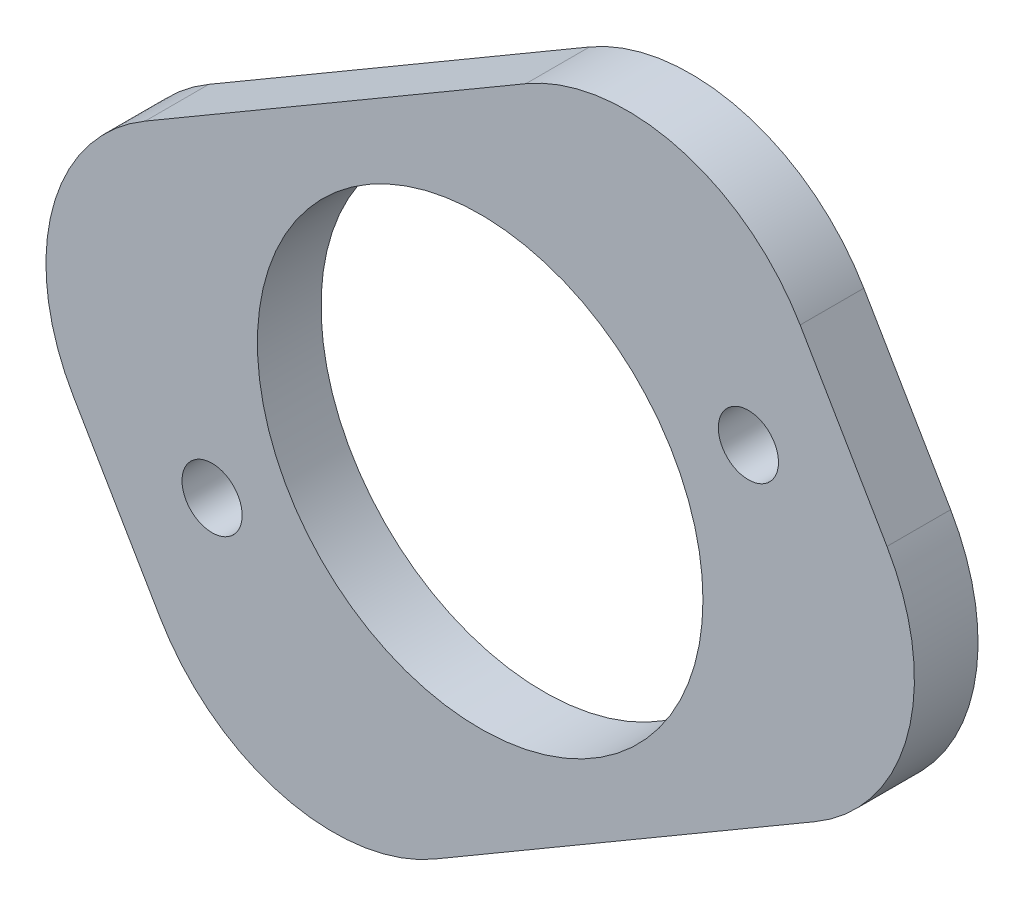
ISO-10303-21;
HEADER;
FILE_DESCRIPTION(('STEP AP214'),'2;1');
FILE_NAME('part.step','',(''),(''),'','','');
FILE_SCHEMA(('AUTOMOTIVE_DESIGN { 1 0 10303 214 1 1 1 1 }'));
ENDSEC;
DATA;
#1=APPLICATION_CONTEXT('core data for automotive mechanical design processes');
#2=APPLICATION_PROTOCOL_DEFINITION('international standard','automotive_design',2000,#1);
#3=PRODUCT_CONTEXT('',#1,'mechanical');
#4=PRODUCT('Part','Part','',(#3));
#5=PRODUCT_RELATED_PRODUCT_CATEGORY('part','',(#4));
#6=PRODUCT_DEFINITION_FORMATION('','',#4);
#7=PRODUCT_DEFINITION_CONTEXT('part definition',#1,'design');
#8=PRODUCT_DEFINITION('design','',#6,#7);
#9=PRODUCT_DEFINITION_SHAPE('','',#8);
#10=(LENGTH_UNIT() NAMED_UNIT(*) SI_UNIT(.MILLI.,.METRE.));
#11=(NAMED_UNIT(*) PLANE_ANGLE_UNIT() SI_UNIT($,.RADIAN.));
#12=(NAMED_UNIT(*) SI_UNIT($,.STERADIAN.) SOLID_ANGLE_UNIT());
#13=UNCERTAINTY_MEASURE_WITH_UNIT(LENGTH_MEASURE(1.E-05),#10,'distance_accuracy_value','');
#14=(GEOMETRIC_REPRESENTATION_CONTEXT(3) GLOBAL_UNCERTAINTY_ASSIGNED_CONTEXT((#13)) GLOBAL_UNIT_ASSIGNED_CONTEXT((#10,
#11,#12)) REPRESENTATION_CONTEXT('',''));
#15=CARTESIAN_POINT('',(0.,0.,0.));
#16=DIRECTION('',(0.,0.,1.));
#17=DIRECTION('',(1.,0.,0.));
#18=AXIS2_PLACEMENT_3D('',#15,#16,#17);
#19=CARTESIAN_POINT('',(129.491108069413,75.7585491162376,3.175));
#20=DIRECTION('',(-0.863133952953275,-0.504975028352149,0.));
#21=DIRECTION('',(0.504975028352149,-0.863133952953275,0.));
#22=AXIS2_PLACEMENT_3D('',#19,#20,#21);
#23=PLANE('',#22);
#24=DIRECTION('',(-0.504975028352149,0.863133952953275,0.));
#25=VECTOR('',#24,1.);
#26=CARTESIAN_POINT('',(129.491108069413,75.7585491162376,3.175));
#27=LINE('',#26,#25);
#28=CARTESIAN_POINT('',(-15.2304439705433,323.125405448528,3.175));
#29=VERTEX_POINT('',#28);
#30=CARTESIAN_POINT('',(-19.560604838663,330.526779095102,3.175));
#31=VERTEX_POINT('',#30);
#32=EDGE_CURVE('E198',#29,#31,#27,.T.);
#33=ORIENTED_EDGE('',*,*,#32,.F.);
#34=DIRECTION('',(0.,0.,-1.));
#35=VECTOR('',#34,1.);
#36=CARTESIAN_POINT('',(-15.2304439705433,323.125405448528,0.));
#37=LINE('',#36,#35);
#38=CARTESIAN_POINT('',(-15.2304439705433,323.125405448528,0.));
#39=VERTEX_POINT('',#38);
#40=EDGE_CURVE('E13',#29,#39,#37,.T.);
#41=ORIENTED_EDGE('',*,*,#40,.T.);
#42=DIRECTION('',(-0.504975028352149,0.863133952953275,0.));
#43=VECTOR('',#42,1.);
#44=CARTESIAN_POINT('',(129.491108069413,75.7585491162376,0.));
#45=LINE('',#44,#43);
#46=CARTESIAN_POINT('',(-19.560604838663,330.526779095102,0.));
#47=VERTEX_POINT('',#46);
#48=EDGE_CURVE('E201',#39,#47,#45,.T.);
#49=ORIENTED_EDGE('',*,*,#48,.T.);
#50=DIRECTION('',(0.,0.,-1.));
#51=VECTOR('',#50,1.);
#52=CARTESIAN_POINT('',(-19.560604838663,330.526779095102,3.175));
#53=LINE('',#52,#51);
#54=EDGE_CURVE('E64',#47,#31,#53,.F.);
#55=ORIENTED_EDGE('',*,*,#54,.T.);
#56=EDGE_LOOP('',(#33,#41,#49,#55));
#57=FACE_BOUND('',#56,.T.);
#58=ADVANCED_FACE('F55',(#57),#23,.F.);
#59=CARTESIAN_POINT('',(-154.101463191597,263.399569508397,3.175));
#60=DIRECTION('',(0.504975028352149,-0.863133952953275,0.));
#61=DIRECTION('',(0.863133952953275,0.504975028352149,0.));
#62=AXIS2_PLACEMENT_3D('',#59,#60,#61);
#63=PLANE('',#62);
#64=DIRECTION('',(-0.863133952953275,-0.504975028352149,0.));
#65=VECTOR('',#64,1.);
#66=CARTESIAN_POINT('',(-154.101463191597,263.399569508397,0.));
#67=LINE('',#66,#65);
#68=CARTESIAN_POINT('',(-33.2416946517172,334.108368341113,0.));
#69=VERTEX_POINT('',#68);
#70=CARTESIAN_POINT('',(-52.2306416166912,322.998917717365,0.));
#71=VERTEX_POINT('',#70);
#72=EDGE_CURVE('E145',#69,#71,#67,.T.);
#73=ORIENTED_EDGE('',*,*,#72,.T.);
#74=DIRECTION('',(0.,0.,-1.));
#75=VECTOR('',#74,1.);
#76=CARTESIAN_POINT('',(-52.2306416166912,322.998917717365,3.175));
#77=LINE('',#76,#75);
#78=CARTESIAN_POINT('',(-52.2306416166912,322.998917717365,3.175));
#79=VERTEX_POINT('',#78);
#80=EDGE_CURVE('E173',#71,#79,#77,.F.);
#81=ORIENTED_EDGE('',*,*,#80,.T.);
#82=DIRECTION('',(-0.863133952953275,-0.504975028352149,0.));
#83=VECTOR('',#82,1.);
#84=CARTESIAN_POINT('',(-154.101463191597,263.399569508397,3.175));
#85=LINE('',#84,#83);
#86=CARTESIAN_POINT('',(-33.2416946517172,334.108368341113,3.175));
#87=VERTEX_POINT('',#86);
#88=EDGE_CURVE('E210',#87,#79,#85,.T.);
#89=ORIENTED_EDGE('',*,*,#88,.F.);
#90=DIRECTION('',(0.,0.,-1.));
#91=VECTOR('',#90,1.);
#92=CARTESIAN_POINT('',(-33.2416946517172,334.108368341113,3.175));
#93=LINE('',#92,#91);
#94=EDGE_CURVE('E169',#87,#69,#93,.T.);
#95=ORIENTED_EDGE('',*,*,#94,.T.);
#96=EDGE_LOOP('',(#73,#81,#89,#95));
#97=FACE_BOUND('',#96,.T.);
#98=ADVANCED_FACE('F216',(#97),#63,.F.);
#99=CARTESIAN_POINT('',(93.2394820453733,54.5495979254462,3.175));
#100=DIRECTION('',(-0.863133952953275,-0.504975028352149,0.));
#101=DIRECTION('',(0.504975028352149,-0.863133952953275,0.));
#102=AXIS2_PLACEMENT_3D('',#99,#100,#101);
#103=PLANE('',#102);
#104=DIRECTION('',(-0.504975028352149,0.863133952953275,0.));
#105=VECTOR('',#104,1.);
#106=CARTESIAN_POINT('',(93.2394820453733,54.5495979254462,3.175));
#107=LINE('',#106,#105);
#108=CARTESIAN_POINT('',(-51.4820699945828,301.916454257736,3.175));
#109=VERTEX_POINT('',#108);
#110=CARTESIAN_POINT('',(-55.8122308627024,309.317827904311,3.175));
#111=VERTEX_POINT('',#110);
#112=EDGE_CURVE('E273',#109,#111,#107,.T.);
#113=ORIENTED_EDGE('',*,*,#112,.T.);
#114=DIRECTION('',(0.,0.,-1.));
#115=VECTOR('',#114,1.);
#116=CARTESIAN_POINT('',(-55.8122308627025,309.317827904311,0.));
#117=LINE('',#116,#115);
#118=CARTESIAN_POINT('',(-55.8122308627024,309.317827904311,0.));
#119=VERTEX_POINT('',#118);
#120=EDGE_CURVE('E143',#111,#119,#117,.T.);
#121=ORIENTED_EDGE('',*,*,#120,.T.);
#122=DIRECTION('',(-0.504975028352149,0.863133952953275,0.));
#123=VECTOR('',#122,1.);
#124=CARTESIAN_POINT('',(93.2394820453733,54.5495979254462,0.));
#125=LINE('',#124,#123);
#126=CARTESIAN_POINT('',(-51.4820699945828,301.916454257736,0.));
#127=VERTEX_POINT('',#126);
#128=EDGE_CURVE('E127',#127,#119,#125,.T.);
#129=ORIENTED_EDGE('',*,*,#128,.F.);
#130=DIRECTION('',(0.,0.,-1.));
#131=VECTOR('',#130,1.);
#132=CARTESIAN_POINT('',(-51.4820699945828,301.916454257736,3.175));
#133=LINE('',#132,#131);
#134=EDGE_CURVE('E141',#127,#109,#133,.F.);
#135=ORIENTED_EDGE('',*,*,#134,.T.);
#136=EDGE_LOOP('',(#113,#121,#129,#135));
#137=FACE_BOUND('',#136,.T.);
#138=ADVANCED_FACE('F140',(#137),#103,.T.);
#139=CARTESIAN_POINT('',(-22.1427611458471,324.048729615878,3.175));
#140=DIRECTION('',(0.,0.,-1.));
#141=DIRECTION('',(-1.,0.,0.));
#142=AXIS2_PLACEMENT_3D('',#139,#140,#141);
#143=CYLINDRICAL_SURFACE('',#142,1.50000000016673);
#144=CARTESIAN_POINT('',(-22.1427611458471,324.048729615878,3.175));
#145=DIRECTION('',(0.,0.,1.));
#146=DIRECTION('',(1.,0.,0.));
#147=AXIS2_PLACEMENT_3D('',#144,#145,#146);
#148=CIRCLE('',#147,1.50000000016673);
#149=CARTESIAN_POINT('',(-20.6427611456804,324.048729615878,3.175));
#150=VERTEX_POINT('',#149);
#151=EDGE_CURVE('E157',#150,#150,#148,.T.);
#152=ORIENTED_EDGE('',*,*,#151,.T.);
#153=EDGE_LOOP('',(#152));
#154=FACE_BOUND('',#153,.T.);
#155=CARTESIAN_POINT('',(-22.1427611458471,324.048729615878,0.));
#156=DIRECTION('',(0.,0.,1.));
#157=DIRECTION('',(1.,0.,0.));
#158=AXIS2_PLACEMENT_3D('',#155,#156,#157);
#159=CIRCLE('',#158,1.50000000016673);
#160=CARTESIAN_POINT('',(-20.6427611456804,324.048729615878,0.));
#161=VERTEX_POINT('',#160);
#162=EDGE_CURVE('E229',#161,#161,#159,.T.);
#163=ORIENTED_EDGE('',*,*,#162,.F.);
#164=EDGE_LOOP('',(#163));
#165=FACE_BOUND('',#164,.T.);
#166=ADVANCED_FACE('F288',(#154,#165),#143,.F.);
#167=CARTESIAN_POINT('',(-35.521337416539,316.221616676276,3.175));
#168=DIRECTION('',(0.,0.,-1.));
#169=DIRECTION('',(-1.,0.,0.));
#170=AXIS2_PLACEMENT_3D('',#167,#168,#169);
#171=CYLINDRICAL_SURFACE('',#170,11.1125000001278);
#172=CARTESIAN_POINT('',(-35.521337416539,316.221616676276,3.175));
#173=DIRECTION('',(0.,0.,1.));
#174=DIRECTION('',(1.,0.,0.));
#175=AXIS2_PLACEMENT_3D('',#172,#173,#174);
#176=CIRCLE('',#175,11.1125000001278);
#177=CARTESIAN_POINT('',(-24.4088374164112,316.221616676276,3.175));
#178=VERTEX_POINT('',#177);
#179=EDGE_CURVE('E272',#178,#178,#176,.T.);
#180=ORIENTED_EDGE('',*,*,#179,.T.);
#181=EDGE_LOOP('',(#180));
#182=FACE_BOUND('',#181,.T.);
#183=CARTESIAN_POINT('',(-35.521337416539,316.221616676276,0.));
#184=DIRECTION('',(0.,0.,1.));
#185=DIRECTION('',(1.,0.,0.));
#186=AXIS2_PLACEMENT_3D('',#183,#184,#185);
#187=CIRCLE('',#186,11.1125000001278);
#188=CARTESIAN_POINT('',(-24.4088374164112,316.221616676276,0.));
#189=VERTEX_POINT('',#188);
#190=EDGE_CURVE('E226',#189,#189,#187,.T.);
#191=ORIENTED_EDGE('',*,*,#190,.F.);
#192=EDGE_LOOP('',(#191));
#193=FACE_BOUND('',#192,.T.);
#194=ADVANCED_FACE('F298',(#182,#193),#171,.F.);
#195=CARTESIAN_POINT('',(-139.671801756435,238.735516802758,3.175));
#196=DIRECTION('',(0.504975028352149,-0.863133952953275,0.));
#197=DIRECTION('',(0.863133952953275,0.504975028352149,0.));
#198=AXIS2_PLACEMENT_3D('',#195,#196,#197);
#199=PLANE('',#198);
#200=DIRECTION('',(-0.863133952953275,-0.504975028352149,0.));
#201=VECTOR('',#200,1.);
#202=CARTESIAN_POINT('',(-139.671801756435,238.735516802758,3.175));
#203=LINE('',#202,#201);
#204=CARTESIAN_POINT('',(-18.8120332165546,309.444315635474,3.175));
#205=VERTEX_POINT('',#204);
#206=CARTESIAN_POINT('',(-37.8009801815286,298.334865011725,3.175));
#207=VERTEX_POINT('',#206);
#208=EDGE_CURVE('E270',#205,#207,#203,.T.);
#209=ORIENTED_EDGE('',*,*,#208,.T.);
#210=DIRECTION('',(0.,0.,-1.));
#211=VECTOR('',#210,1.);
#212=CARTESIAN_POINT('',(-37.8009801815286,298.334865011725,3.175));
#213=LINE('',#212,#211);
#214=CARTESIAN_POINT('',(-37.8009801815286,298.334865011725,0.));
#215=VERTEX_POINT('',#214);
#216=EDGE_CURVE('E189',#207,#215,#213,.T.);
#217=ORIENTED_EDGE('',*,*,#216,.T.);
#218=DIRECTION('',(-0.863133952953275,-0.504975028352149,0.));
#219=VECTOR('',#218,1.);
#220=CARTESIAN_POINT('',(-139.671801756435,238.735516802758,0.));
#221=LINE('',#220,#219);
#222=CARTESIAN_POINT('',(-18.8120332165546,309.444315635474,0.));
#223=VERTEX_POINT('',#222);
#224=EDGE_CURVE('E128',#223,#215,#221,.T.);
#225=ORIENTED_EDGE('',*,*,#224,.F.);
#226=DIRECTION('',(0.,0.,-1.));
#227=VECTOR('',#226,1.);
#228=CARTESIAN_POINT('',(-18.8120332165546,309.444315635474,3.175));
#229=LINE('',#228,#227);
#230=EDGE_CURVE('E78',#223,#205,#229,.F.);
#231=ORIENTED_EDGE('',*,*,#230,.T.);
#232=EDGE_LOOP('',(#209,#217,#225,#231));
#233=FACE_BOUND('',#232,.T.);
#234=ADVANCED_FACE('F269',(#233),#199,.T.);
#235=CARTESIAN_POINT('',(-48.8945332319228,308.385314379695,3.175));
#236=DIRECTION('',(0.,0.,-1.));
#237=DIRECTION('',(-1.,0.,0.));
#238=AXIS2_PLACEMENT_3D('',#235,#236,#237);
#239=CYLINDRICAL_SURFACE('',#238,1.50000000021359);
#240=CARTESIAN_POINT('',(-48.8945332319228,308.385314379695,3.175));
#241=DIRECTION('',(0.,0.,1.));
#242=DIRECTION('',(1.,0.,0.));
#243=AXIS2_PLACEMENT_3D('',#240,#241,#242);
#244=CIRCLE('',#243,1.50000000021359);
#245=CARTESIAN_POINT('',(-47.3945332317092,308.385314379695,3.175));
#246=VERTEX_POINT('',#245);
#247=EDGE_CURVE('E149',#246,#246,#244,.F.);
#248=ORIENTED_EDGE('',*,*,#247,.F.);
#249=EDGE_LOOP('',(#248));
#250=FACE_BOUND('',#249,.T.);
#251=CARTESIAN_POINT('',(-48.8945332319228,308.385314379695,0.));
#252=DIRECTION('',(0.,0.,1.));
#253=DIRECTION('',(1.,0.,0.));
#254=AXIS2_PLACEMENT_3D('',#251,#252,#253);
#255=CIRCLE('',#254,1.50000000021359);
#256=CARTESIAN_POINT('',(-47.3945332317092,308.385314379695,0.));
#257=VERTEX_POINT('',#256);
#258=EDGE_CURVE('E160',#257,#257,#255,.F.);
#259=ORIENTED_EDGE('',*,*,#258,.T.);
#260=EDGE_LOOP('',(#259));
#261=FACE_BOUND('',#260,.T.);
#262=ADVANCED_FACE('F240',(#250,#261),#239,.F.);
#263=CARTESIAN_POINT('',(0.,0.,3.175));
#264=DIRECTION('',(0.,0.,1.));
#265=DIRECTION('',(1.,0.,0.));
#266=AXIS2_PLACEMENT_3D('',#263,#264,#265);
#267=PLANE('',#266);
#268=ORIENTED_EDGE('',*,*,#88,.T.);
#269=CARTESIAN_POINT('',(-47.1808913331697,314.367578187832,3.175));
#270=DIRECTION('',(0.,0.,1.));
#271=DIRECTION('',(1.,0.,0.));
#272=AXIS2_PLACEMENT_3D('',#269,#270,#271);
#273=CIRCLE('',#272,10.);
#274=EDGE_CURVE('E184',#79,#111,#273,.T.);
#275=ORIENTED_EDGE('',*,*,#274,.T.);
#276=ORIENTED_EDGE('',*,*,#112,.F.);
#277=CARTESIAN_POINT('',(-42.8507304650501,306.966204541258,3.175));
#278=DIRECTION('',(0.,0.,1.));
#279=DIRECTION('',(1.,0.,0.));
#280=AXIS2_PLACEMENT_3D('',#277,#278,#279);
#281=CIRCLE('',#280,10.);
#282=EDGE_CURVE('E71',#109,#207,#281,.T.);
#283=ORIENTED_EDGE('',*,*,#282,.T.);
#284=ORIENTED_EDGE('',*,*,#208,.F.);
#285=CARTESIAN_POINT('',(-23.8617835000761,318.075655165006,3.175));
#286=DIRECTION('',(0.,0.,1.));
#287=DIRECTION('',(1.,0.,0.));
#288=AXIS2_PLACEMENT_3D('',#285,#286,#287);
#289=CIRCLE('',#288,10.);
#290=EDGE_CURVE('E179',#205,#29,#289,.T.);
#291=ORIENTED_EDGE('',*,*,#290,.T.);
#292=ORIENTED_EDGE('',*,*,#32,.T.);
#293=CARTESIAN_POINT('',(-28.1919443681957,325.477028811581,3.175));
#294=DIRECTION('',(0.,0.,1.));
#295=DIRECTION('',(1.,0.,0.));
#296=AXIS2_PLACEMENT_3D('',#293,#294,#295);
#297=CIRCLE('',#296,10.);
#298=EDGE_CURVE('E176',#31,#87,#297,.T.);
#299=ORIENTED_EDGE('',*,*,#298,.T.);
#300=EDGE_LOOP('',(#268,#275,#276,#283,#284,#291,#292,#299));
#301=FACE_BOUND('',#300,.T.);
#302=ORIENTED_EDGE('',*,*,#179,.F.);
#303=EDGE_LOOP('',(#302));
#304=FACE_BOUND('',#303,.T.);
#305=ORIENTED_EDGE('',*,*,#151,.F.);
#306=EDGE_LOOP('',(#305));
#307=FACE_BOUND('',#306,.T.);
#308=ORIENTED_EDGE('',*,*,#247,.T.);
#309=EDGE_LOOP('',(#308));
#310=FACE_BOUND('',#309,.T.);
#311=ADVANCED_FACE('F205',(#301,#304,#307,#310),#267,.T.);
#312=CARTESIAN_POINT('',(0.,0.,0.));
#313=DIRECTION('',(0.,0.,1.));
#314=DIRECTION('',(1.,0.,0.));
#315=AXIS2_PLACEMENT_3D('',#312,#313,#314);
#316=PLANE('',#315);
#317=ORIENTED_EDGE('',*,*,#128,.T.);
#318=CARTESIAN_POINT('',(-47.1808913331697,314.367578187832,0.));
#319=DIRECTION('',(0.,0.,1.));
#320=DIRECTION('',(1.,0.,0.));
#321=AXIS2_PLACEMENT_3D('',#318,#319,#320);
#322=CIRCLE('',#321,10.);
#323=EDGE_CURVE('E134',#119,#71,#322,.F.);
#324=ORIENTED_EDGE('',*,*,#323,.T.);
#325=ORIENTED_EDGE('',*,*,#72,.F.);
#326=CARTESIAN_POINT('',(-28.1919443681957,325.477028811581,0.));
#327=DIRECTION('',(0.,0.,1.));
#328=DIRECTION('',(1.,0.,0.));
#329=AXIS2_PLACEMENT_3D('',#326,#327,#328);
#330=CIRCLE('',#329,10.);
#331=EDGE_CURVE('E154',#69,#47,#330,.F.);
#332=ORIENTED_EDGE('',*,*,#331,.T.);
#333=ORIENTED_EDGE('',*,*,#48,.F.);
#334=CARTESIAN_POINT('',(-23.8617835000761,318.075655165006,0.));
#335=DIRECTION('',(0.,0.,1.));
#336=DIRECTION('',(1.,0.,0.));
#337=AXIS2_PLACEMENT_3D('',#334,#335,#336);
#338=CIRCLE('',#337,10.);
#339=EDGE_CURVE('E135',#39,#223,#338,.F.);
#340=ORIENTED_EDGE('',*,*,#339,.T.);
#341=ORIENTED_EDGE('',*,*,#224,.T.);
#342=CARTESIAN_POINT('',(-42.8507304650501,306.966204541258,0.));
#343=DIRECTION('',(0.,0.,1.));
#344=DIRECTION('',(1.,0.,0.));
#345=AXIS2_PLACEMENT_3D('',#342,#343,#344);
#346=CIRCLE('',#345,10.);
#347=EDGE_CURVE('E123',#215,#127,#346,.F.);
#348=ORIENTED_EDGE('',*,*,#347,.T.);
#349=EDGE_LOOP('',(#317,#324,#325,#332,#333,#340,#341,#348));
#350=FACE_BOUND('',#349,.T.);
#351=ORIENTED_EDGE('',*,*,#190,.T.);
#352=EDGE_LOOP('',(#351));
#353=FACE_BOUND('',#352,.T.);
#354=ORIENTED_EDGE('',*,*,#162,.T.);
#355=EDGE_LOOP('',(#354));
#356=FACE_BOUND('',#355,.T.);
#357=ORIENTED_EDGE('',*,*,#258,.F.);
#358=EDGE_LOOP('',(#357));
#359=FACE_BOUND('',#358,.T.);
#360=ADVANCED_FACE('F125',(#350,#353,#356,#359),#316,.F.);
#361=CARTESIAN_POINT('',(-47.1808913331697,314.367578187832,3.175));
#362=DIRECTION('',(0.,0.,1.));
#363=DIRECTION('',(1.,0.,0.));
#364=AXIS2_PLACEMENT_3D('',#361,#362,#363);
#365=CYLINDRICAL_SURFACE('',#364,10.);
#366=ORIENTED_EDGE('',*,*,#274,.F.);
#367=ORIENTED_EDGE('',*,*,#80,.F.);
#368=ORIENTED_EDGE('',*,*,#323,.F.);
#369=ORIENTED_EDGE('',*,*,#120,.F.);
#370=EDGE_LOOP('',(#366,#367,#368,#369));
#371=FACE_BOUND('',#370,.T.);
#372=ADVANCED_FACE('F243',(#371),#365,.T.);
#373=CARTESIAN_POINT('',(-42.8507304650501,306.966204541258,3.175));
#374=DIRECTION('',(0.,0.,-1.));
#375=DIRECTION('',(-1.,0.,0.));
#376=AXIS2_PLACEMENT_3D('',#373,#374,#375);
#377=CYLINDRICAL_SURFACE('',#376,10.);
#378=ORIENTED_EDGE('',*,*,#282,.F.);
#379=ORIENTED_EDGE('',*,*,#134,.F.);
#380=ORIENTED_EDGE('',*,*,#347,.F.);
#381=ORIENTED_EDGE('',*,*,#216,.F.);
#382=EDGE_LOOP('',(#378,#379,#380,#381));
#383=FACE_BOUND('',#382,.T.);
#384=ADVANCED_FACE('F147',(#383),#377,.T.);
#385=CARTESIAN_POINT('',(-23.8617835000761,318.075655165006,3.175));
#386=DIRECTION('',(0.,0.,1.));
#387=DIRECTION('',(1.,0.,0.));
#388=AXIS2_PLACEMENT_3D('',#385,#386,#387);
#389=CYLINDRICAL_SURFACE('',#388,10.);
#390=ORIENTED_EDGE('',*,*,#290,.F.);
#391=ORIENTED_EDGE('',*,*,#230,.F.);
#392=ORIENTED_EDGE('',*,*,#339,.F.);
#393=ORIENTED_EDGE('',*,*,#40,.F.);
#394=EDGE_LOOP('',(#390,#391,#392,#393));
#395=FACE_BOUND('',#394,.T.);
#396=ADVANCED_FACE('F263',(#395),#389,.T.);
#397=CARTESIAN_POINT('',(-28.1919443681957,325.477028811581,3.175));
#398=DIRECTION('',(0.,0.,-1.));
#399=DIRECTION('',(-1.,0.,0.));
#400=AXIS2_PLACEMENT_3D('',#397,#398,#399);
#401=CYLINDRICAL_SURFACE('',#400,10.);
#402=ORIENTED_EDGE('',*,*,#298,.F.);
#403=ORIENTED_EDGE('',*,*,#54,.F.);
#404=ORIENTED_EDGE('',*,*,#331,.F.);
#405=ORIENTED_EDGE('',*,*,#94,.F.);
#406=EDGE_LOOP('',(#402,#403,#404,#405));
#407=FACE_BOUND('',#406,.T.);
#408=ADVANCED_FACE('F57',(#407),#401,.T.);
#409=CLOSED_SHELL('',(#58,#98,#138,#166,#194,#234,#262,#311,#360,#372,#384,#396,#408));
#410=MANIFOLD_SOLID_BREP('B2',#409);
#411=ADVANCED_BREP_SHAPE_REPRESENTATION('',(#18,#410),#14);
#412=SHAPE_DEFINITION_REPRESENTATION(#9,#411);
ENDSEC;
END-ISO-10303-21;
